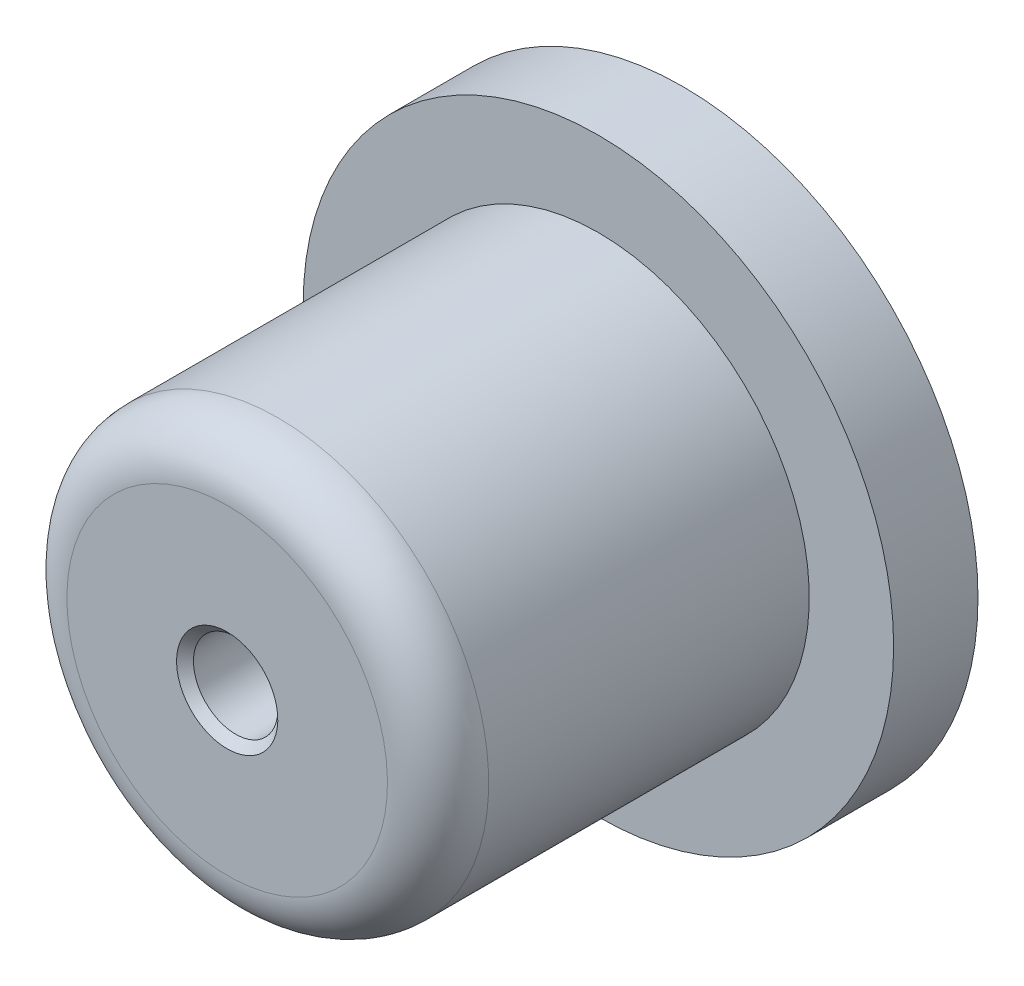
ISO-10303-21;
HEADER;
FILE_DESCRIPTION(('STEP AP214'),'2;1');
FILE_NAME('part.step','',(''),(''),'','','');
FILE_SCHEMA(('AUTOMOTIVE_DESIGN { 1 0 10303 214 1 1 1 1 }'));
ENDSEC;
DATA;
#1=APPLICATION_CONTEXT('core data for automotive mechanical design processes');
#2=APPLICATION_PROTOCOL_DEFINITION('international standard','automotive_design',2000,#1);
#3=PRODUCT_CONTEXT('',#1,'mechanical');
#4=PRODUCT('Part','Part','',(#3));
#5=PRODUCT_RELATED_PRODUCT_CATEGORY('part','',(#4));
#6=PRODUCT_DEFINITION_FORMATION('','',#4);
#7=PRODUCT_DEFINITION_CONTEXT('part definition',#1,'design');
#8=PRODUCT_DEFINITION('design','',#6,#7);
#9=PRODUCT_DEFINITION_SHAPE('','',#8);
#10=(LENGTH_UNIT() NAMED_UNIT(*) SI_UNIT(.MILLI.,.METRE.));
#11=(NAMED_UNIT(*) PLANE_ANGLE_UNIT() SI_UNIT($,.RADIAN.));
#12=(NAMED_UNIT(*) SI_UNIT($,.STERADIAN.) SOLID_ANGLE_UNIT());
#13=UNCERTAINTY_MEASURE_WITH_UNIT(LENGTH_MEASURE(1.E-05),#10,'distance_accuracy_value','');
#14=(GEOMETRIC_REPRESENTATION_CONTEXT(3) GLOBAL_UNCERTAINTY_ASSIGNED_CONTEXT((#13)) GLOBAL_UNIT_ASSIGNED_CONTEXT((#10,
#11,#12)) REPRESENTATION_CONTEXT('',''));
#15=CARTESIAN_POINT('',(0.,0.,0.));
#16=DIRECTION('',(0.,0.,1.));
#17=DIRECTION('',(1.,0.,0.));
#18=AXIS2_PLACEMENT_3D('',#15,#16,#17);
#19=CARTESIAN_POINT('',(0.,0.,0.));
#20=DIRECTION('',(0.,0.,-1.));
#21=DIRECTION('',(0.,1.,0.));
#22=AXIS2_PLACEMENT_3D('',#19,#20,#21);
#23=PLANE('',#22);
#24=CARTESIAN_POINT('',(0.,0.,0.));
#25=DIRECTION('',(0.,0.,-1.));
#26=DIRECTION('',(0.,1.,0.));
#27=AXIS2_PLACEMENT_3D('',#24,#25,#26);
#28=CIRCLE('',#27,17.5);
#29=CARTESIAN_POINT('',(0.,17.5,0.));
#30=VERTEX_POINT('',#29);
#31=EDGE_CURVE('E11',#30,#30,#28,.T.);
#32=ORIENTED_EDGE('',*,*,#31,.T.);
#33=EDGE_LOOP('',(#32));
#34=FACE_BOUND('',#33,.T.);
#35=ADVANCED_FACE('F34',(#34),#23,.T.);
#36=CARTESIAN_POINT('',(0.,0.,0.));
#37=DIRECTION('',(0.,0.,-1.));
#38=DIRECTION('',(0.,1.,0.));
#39=AXIS2_PLACEMENT_3D('',#36,#37,#38);
#40=CYLINDRICAL_SURFACE('',#39,17.5);
#41=CARTESIAN_POINT('',(0.,0.,5.));
#42=DIRECTION('',(0.,0.,-1.));
#43=DIRECTION('',(0.,1.,0.));
#44=AXIS2_PLACEMENT_3D('',#41,#42,#43);
#45=CIRCLE('',#44,17.5);
#46=CARTESIAN_POINT('',(0.,17.5,5.));
#47=VERTEX_POINT('',#46);
#48=EDGE_CURVE('E40',#47,#47,#45,.T.);
#49=ORIENTED_EDGE('',*,*,#48,.T.);
#50=EDGE_LOOP('',(#49));
#51=FACE_BOUND('',#50,.T.);
#52=ORIENTED_EDGE('',*,*,#31,.F.);
#53=EDGE_LOOP('',(#52));
#54=FACE_BOUND('',#53,.T.);
#55=ADVANCED_FACE('F71',(#51,#54),#40,.T.);
#56=CARTESIAN_POINT('',(0.,17.5,5.));
#57=DIRECTION('',(0.,0.,1.));
#58=DIRECTION('',(0.,-1.,0.));
#59=AXIS2_PLACEMENT_3D('',#56,#57,#58);
#60=PLANE('',#59);
#61=CARTESIAN_POINT('',(0.,0.,5.));
#62=DIRECTION('',(0.,0.,-1.));
#63=DIRECTION('',(0.,1.,0.));
#64=AXIS2_PLACEMENT_3D('',#61,#62,#63);
#65=CIRCLE('',#64,12.5);
#66=CARTESIAN_POINT('',(0.,12.5,5.));
#67=VERTEX_POINT('',#66);
#68=EDGE_CURVE('E66',#67,#67,#65,.T.);
#69=ORIENTED_EDGE('',*,*,#68,.T.);
#70=EDGE_LOOP('',(#69));
#71=FACE_BOUND('',#70,.T.);
#72=ORIENTED_EDGE('',*,*,#48,.F.);
#73=EDGE_LOOP('',(#72));
#74=FACE_BOUND('',#73,.T.);
#75=ADVANCED_FACE('F74',(#71,#74),#60,.T.);
#76=CARTESIAN_POINT('',(0.,0.,0.));
#77=DIRECTION('',(0.,0.,-1.));
#78=DIRECTION('',(0.,1.,0.));
#79=AXIS2_PLACEMENT_3D('',#76,#77,#78);
#80=CYLINDRICAL_SURFACE('',#79,12.5);
#81=CARTESIAN_POINT('',(0.,0.,24.));
#82=DIRECTION('',(0.,0.,-1.));
#83=DIRECTION('',(0.,1.,0.));
#84=AXIS2_PLACEMENT_3D('',#81,#82,#83);
#85=CIRCLE('',#84,12.5);
#86=CARTESIAN_POINT('',(0.,12.5,24.));
#87=VERTEX_POINT('',#86);
#88=EDGE_CURVE('E63',#87,#87,#85,.T.);
#89=ORIENTED_EDGE('',*,*,#88,.T.);
#90=EDGE_LOOP('',(#89));
#91=FACE_BOUND('',#90,.T.);
#92=ORIENTED_EDGE('',*,*,#68,.F.);
#93=EDGE_LOOP('',(#92));
#94=FACE_BOUND('',#93,.T.);
#95=ADVANCED_FACE('F76',(#91,#94),#80,.T.);
#96=CARTESIAN_POINT('',(0.,0.,24.));
#97=DIRECTION('',(0.,0.,-1.));
#98=DIRECTION('',(0.,1.,0.));
#99=AXIS2_PLACEMENT_3D('',#96,#97,#98);
#100=TOROIDAL_SURFACE('',#99,9.5,3.);
#101=CARTESIAN_POINT('',(0.,0.,27.));
#102=DIRECTION('',(0.,0.,-1.));
#103=DIRECTION('',(0.,1.,0.));
#104=AXIS2_PLACEMENT_3D('',#101,#102,#103);
#105=CIRCLE('',#104,9.5);
#106=CARTESIAN_POINT('',(0.,9.5,27.));
#107=VERTEX_POINT('',#106);
#108=EDGE_CURVE('E60',#107,#107,#105,.T.);
#109=ORIENTED_EDGE('',*,*,#108,.T.);
#110=EDGE_LOOP('',(#109));
#111=FACE_BOUND('',#110,.T.);
#112=ORIENTED_EDGE('',*,*,#88,.F.);
#113=EDGE_LOOP('',(#112));
#114=FACE_BOUND('',#113,.T.);
#115=ADVANCED_FACE('F83',(#111,#114),#100,.T.);
#116=CARTESIAN_POINT('',(0.,9.5,27.));
#117=DIRECTION('',(0.,0.,1.));
#118=DIRECTION('',(0.,-1.,0.));
#119=AXIS2_PLACEMENT_3D('',#116,#117,#118);
#120=PLANE('',#119);
#121=CARTESIAN_POINT('',(0.,0.,27.));
#122=DIRECTION('',(0.,0.,-1.));
#123=DIRECTION('',(0.,1.,0.));
#124=AXIS2_PLACEMENT_3D('',#121,#122,#123);
#125=CIRCLE('',#124,3.00000000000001);
#126=CARTESIAN_POINT('',(0.,3.,27.));
#127=VERTEX_POINT('',#126);
#128=EDGE_CURVE('E55',#127,#127,#125,.T.);
#129=ORIENTED_EDGE('',*,*,#128,.T.);
#130=EDGE_LOOP('',(#129));
#131=FACE_BOUND('',#130,.T.);
#132=ORIENTED_EDGE('',*,*,#108,.F.);
#133=EDGE_LOOP('',(#132));
#134=FACE_BOUND('',#133,.T.);
#135=ADVANCED_FACE('F115',(#131,#134),#120,.T.);
#136=CARTESIAN_POINT('',(0.,0.,27.));
#137=DIRECTION('',(0.,0.,1.));
#138=DIRECTION('',(0.,-1.,0.));
#139=AXIS2_PLACEMENT_3D('',#136,#137,#138);
#140=CONICAL_SURFACE('',#139,3.00000000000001,0.785398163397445);
#141=CARTESIAN_POINT('',(0.,0.,26.5));
#142=DIRECTION('',(0.,0.,-1.));
#143=DIRECTION('',(0.,1.,0.));
#144=AXIS2_PLACEMENT_3D('',#141,#142,#143);
#145=CIRCLE('',#144,2.5);
#146=CARTESIAN_POINT('',(0.,2.5,26.5));
#147=VERTEX_POINT('',#146);
#148=EDGE_CURVE('E52',#147,#147,#145,.T.);
#149=ORIENTED_EDGE('',*,*,#148,.T.);
#150=EDGE_LOOP('',(#149));
#151=FACE_BOUND('',#150,.T.);
#152=ORIENTED_EDGE('',*,*,#128,.F.);
#153=EDGE_LOOP('',(#152));
#154=FACE_BOUND('',#153,.T.);
#155=ADVANCED_FACE('F125',(#151,#154),#140,.F.);
#156=CARTESIAN_POINT('',(0.,0.,0.));
#157=DIRECTION('',(0.,0.,-1.));
#158=DIRECTION('',(0.,1.,0.));
#159=AXIS2_PLACEMENT_3D('',#156,#157,#158);
#160=CYLINDRICAL_SURFACE('',#159,2.5);
#161=CARTESIAN_POINT('',(0.,0.,21.));
#162=DIRECTION('',(0.,0.,-1.));
#163=DIRECTION('',(0.,1.,0.));
#164=AXIS2_PLACEMENT_3D('',#161,#162,#163);
#165=CIRCLE('',#164,2.5);
#166=CARTESIAN_POINT('',(0.,2.5,21.));
#167=VERTEX_POINT('',#166);
#168=EDGE_CURVE('E50',#167,#167,#165,.T.);
#169=ORIENTED_EDGE('',*,*,#168,.T.);
#170=EDGE_LOOP('',(#169));
#171=FACE_BOUND('',#170,.T.);
#172=ORIENTED_EDGE('',*,*,#148,.F.);
#173=EDGE_LOOP('',(#172));
#174=FACE_BOUND('',#173,.T.);
#175=ADVANCED_FACE('F46',(#171,#174),#160,.F.);
#176=CARTESIAN_POINT('',(0.,0.,21.));
#177=DIRECTION('',(0.,0.,1.));
#178=DIRECTION('',(0.,-1.,0.));
#179=AXIS2_PLACEMENT_3D('',#176,#177,#178);
#180=CONICAL_SURFACE('',#179,2.5,0.959931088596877);
#181=CARTESIAN_POINT('',(0.,0.,19.2494811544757));
#182=VERTEX_POINT('',#181);
#183=VERTEX_LOOP('',#182);
#184=FACE_BOUND('',#183,.T.);
#185=ORIENTED_EDGE('',*,*,#168,.F.);
#186=EDGE_LOOP('',(#185));
#187=FACE_BOUND('',#186,.T.);
#188=ADVANCED_FACE('F43',(#184,#187),#180,.F.);
#189=CLOSED_SHELL('',(#35,#55,#75,#95,#115,#135,#155,#175,#188));
#190=MANIFOLD_SOLID_BREP('B2',#189);
#191=ADVANCED_BREP_SHAPE_REPRESENTATION('',(#18,#190),#14);
#192=SHAPE_DEFINITION_REPRESENTATION(#9,#191);
ENDSEC;
END-ISO-10303-21;
